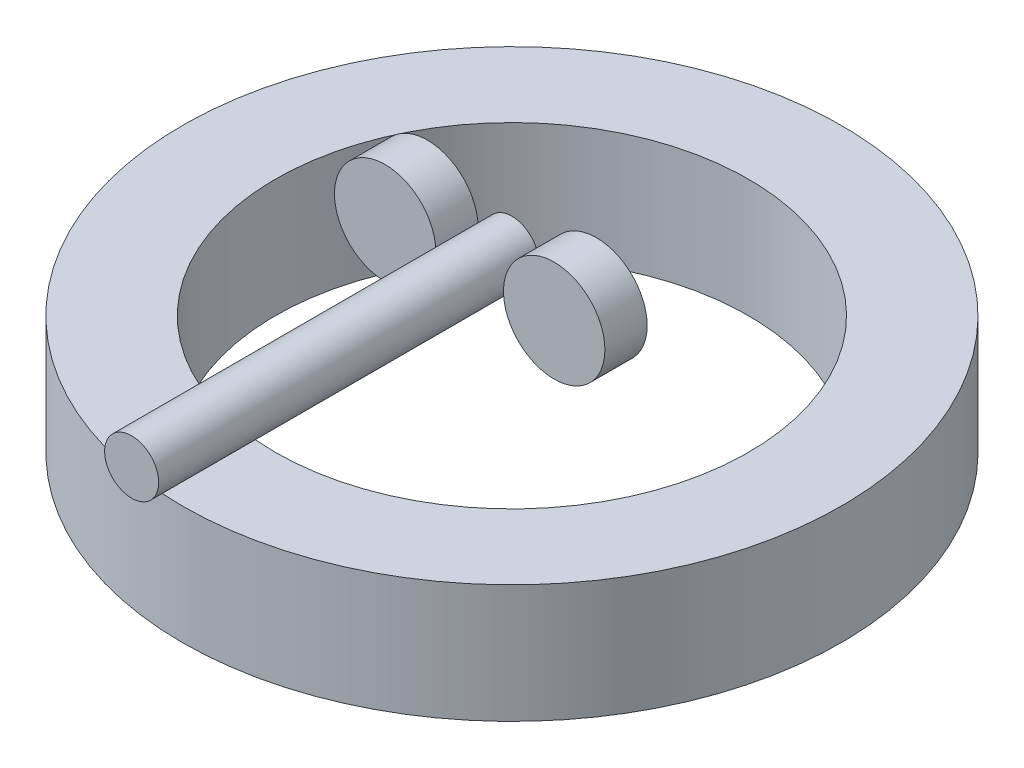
ISO-10303-21;
HEADER;
FILE_DESCRIPTION(('STEP AP214'),'2;1');
FILE_NAME('part.step','',(''),(''),'','','');
FILE_SCHEMA(('AUTOMOTIVE_DESIGN { 1 0 10303 214 1 1 1 1 }'));
ENDSEC;
DATA;
#1=APPLICATION_CONTEXT('core data for automotive mechanical design processes');
#2=APPLICATION_PROTOCOL_DEFINITION('international standard','automotive_design',2000,#1);
#3=PRODUCT_CONTEXT('',#1,'mechanical');
#4=PRODUCT('Part','Part','',(#3));
#5=PRODUCT_RELATED_PRODUCT_CATEGORY('part','',(#4));
#6=PRODUCT_DEFINITION_FORMATION('','',#4);
#7=PRODUCT_DEFINITION_CONTEXT('part definition',#1,'design');
#8=PRODUCT_DEFINITION('design','',#6,#7);
#9=PRODUCT_DEFINITION_SHAPE('','',#8);
#10=(LENGTH_UNIT() NAMED_UNIT(*) SI_UNIT(.MILLI.,.METRE.));
#11=(NAMED_UNIT(*) PLANE_ANGLE_UNIT() SI_UNIT($,.RADIAN.));
#12=(NAMED_UNIT(*) SI_UNIT($,.STERADIAN.) SOLID_ANGLE_UNIT());
#13=UNCERTAINTY_MEASURE_WITH_UNIT(LENGTH_MEASURE(1.E-05),#10,'distance_accuracy_value','');
#14=(GEOMETRIC_REPRESENTATION_CONTEXT(3) GLOBAL_UNCERTAINTY_ASSIGNED_CONTEXT((#13)) GLOBAL_UNIT_ASSIGNED_CONTEXT((#10,
#11,#12)) REPRESENTATION_CONTEXT('',''));
#15=CARTESIAN_POINT('',(0.,0.,0.));
#16=DIRECTION('',(0.,0.,1.));
#17=DIRECTION('',(1.,0.,0.));
#18=AXIS2_PLACEMENT_3D('',#15,#16,#17);
#19=CARTESIAN_POINT('',(2500.,1750.,1250.));
#20=DIRECTION('',(0.,0.,-1.));
#21=DIRECTION('',(-1.,0.,0.));
#22=AXIS2_PLACEMENT_3D('',#19,#20,#21);
#23=CYLINDRICAL_SURFACE('',#22,1500.);
#24=CARTESIAN_POINT('',(2500.,1750.,1250.));
#25=DIRECTION('',(0.,0.,1.));
#26=DIRECTION('',(1.,0.,0.));
#27=AXIS2_PLACEMENT_3D('',#24,#25,#26);
#28=CIRCLE('',#27,1500.);
#29=CARTESIAN_POINT('',(4000.,1750.,1250.));
#30=VERTEX_POINT('',#29);
#31=EDGE_CURVE('E49',#30,#30,#28,.T.);
#32=ORIENTED_EDGE('',*,*,#31,.F.);
#33=EDGE_LOOP('',(#32));
#34=FACE_BOUND('',#33,.T.);
#35=CARTESIAN_POINT('',(2500.,1750.,0.));
#36=DIRECTION('',(0.,0.,1.));
#37=DIRECTION('',(1.,0.,0.));
#38=AXIS2_PLACEMENT_3D('',#35,#36,#37);
#39=CIRCLE('',#38,1500.);
#40=CARTESIAN_POINT('',(4000.,1750.,0.));
#41=VERTEX_POINT('',#40);
#42=EDGE_CURVE('E11',#41,#41,#39,.T.);
#43=ORIENTED_EDGE('',*,*,#42,.T.);
#44=EDGE_LOOP('',(#43));
#45=FACE_BOUND('',#44,.T.);
#46=ADVANCED_FACE('F46',(#34,#45),#23,.T.);
#47=CARTESIAN_POINT('',(2500.,1750.,1250.));
#48=DIRECTION('',(0.,0.,1.));
#49=DIRECTION('',(1.,0.,0.));
#50=AXIS2_PLACEMENT_3D('',#47,#48,#49);
#51=PLANE('',#50);
#52=ORIENTED_EDGE('',*,*,#31,.T.);
#53=EDGE_LOOP('',(#52));
#54=FACE_BOUND('',#53,.T.);
#55=ADVANCED_FACE('F48',(#54),#51,.T.);
#56=CARTESIAN_POINT('',(2500.,1750.,0.));
#57=DIRECTION('',(0.,0.,1.));
#58=DIRECTION('',(1.,0.,0.));
#59=AXIS2_PLACEMENT_3D('',#56,#57,#58);
#60=PLANE('',#59);
#61=ORIENTED_EDGE('',*,*,#42,.F.);
#62=EDGE_LOOP('',(#61));
#63=FACE_BOUND('',#62,.T.);
#64=ADVANCED_FACE('F64',(#63),#60,.F.);
#65=CLOSED_SHELL('',(#46,#55,#64));
#66=MANIFOLD_SOLID_BREP('B2',#65);
#67=CARTESIAN_POINT('',(-2500.,1750.,1250.));
#68=DIRECTION('',(0.,0.,-1.));
#69=DIRECTION('',(-1.,0.,0.));
#70=AXIS2_PLACEMENT_3D('',#67,#68,#69);
#71=CYLINDRICAL_SURFACE('',#70,1500.);
#72=CARTESIAN_POINT('',(-2500.,1750.,1250.));
#73=DIRECTION('',(0.,0.,1.));
#74=DIRECTION('',(1.,0.,0.));
#75=AXIS2_PLACEMENT_3D('',#72,#73,#74);
#76=CIRCLE('',#75,1500.);
#77=CARTESIAN_POINT('',(-1000.,1750.,1250.));
#78=VERTEX_POINT('',#77);
#79=EDGE_CURVE('E44',#78,#78,#76,.T.);
#80=ORIENTED_EDGE('',*,*,#79,.F.);
#81=EDGE_LOOP('',(#80));
#82=FACE_BOUND('',#81,.T.);
#83=CARTESIAN_POINT('',(-2500.,1750.,0.));
#84=DIRECTION('',(0.,0.,1.));
#85=DIRECTION('',(1.,0.,0.));
#86=AXIS2_PLACEMENT_3D('',#83,#84,#85);
#87=CIRCLE('',#86,1500.);
#88=CARTESIAN_POINT('',(-1000.,1750.,0.));
#89=VERTEX_POINT('',#88);
#90=EDGE_CURVE('E98',#89,#89,#87,.T.);
#91=ORIENTED_EDGE('',*,*,#90,.T.);
#92=EDGE_LOOP('',(#91));
#93=FACE_BOUND('',#92,.T.);
#94=ADVANCED_FACE('F92',(#82,#93),#71,.T.);
#95=CARTESIAN_POINT('',(-2500.,1750.,1250.));
#96=DIRECTION('',(0.,0.,1.));
#97=DIRECTION('',(1.,0.,0.));
#98=AXIS2_PLACEMENT_3D('',#95,#96,#97);
#99=PLANE('',#98);
#100=ORIENTED_EDGE('',*,*,#79,.T.);
#101=EDGE_LOOP('',(#100));
#102=FACE_BOUND('',#101,.T.);
#103=ADVANCED_FACE('F109',(#102),#99,.T.);
#104=CARTESIAN_POINT('',(-2500.,1750.,0.));
#105=DIRECTION('',(0.,0.,1.));
#106=DIRECTION('',(1.,0.,0.));
#107=AXIS2_PLACEMENT_3D('',#104,#105,#106);
#108=PLANE('',#107);
#109=ORIENTED_EDGE('',*,*,#90,.F.);
#110=EDGE_LOOP('',(#109));
#111=FACE_BOUND('',#110,.T.);
#112=ADVANCED_FACE('F107',(#111),#108,.F.);
#113=CLOSED_SHELL('',(#94,#103,#112));
#114=MANIFOLD_SOLID_BREP('B6',#113);
#115=CARTESIAN_POINT('',(0.,1750.,11250.));
#116=DIRECTION('',(0.,0.,-1.));
#117=DIRECTION('',(-1.,0.,0.));
#118=AXIS2_PLACEMENT_3D('',#115,#116,#117);
#119=CYLINDRICAL_SURFACE('',#118,800.);
#120=CARTESIAN_POINT('',(0.,1750.,11250.));
#121=DIRECTION('',(0.,0.,1.));
#122=DIRECTION('',(1.,0.,0.));
#123=AXIS2_PLACEMENT_3D('',#120,#121,#122);
#124=CIRCLE('',#123,800.);
#125=CARTESIAN_POINT('',(800.,1750.,11250.));
#126=VERTEX_POINT('',#125);
#127=EDGE_CURVE('E94',#126,#126,#124,.T.);
#128=ORIENTED_EDGE('',*,*,#127,.F.);
#129=EDGE_LOOP('',(#128));
#130=FACE_BOUND('',#129,.T.);
#131=CARTESIAN_POINT('',(0.,1750.,0.));
#132=DIRECTION('',(0.,0.,1.));
#133=DIRECTION('',(1.,0.,0.));
#134=AXIS2_PLACEMENT_3D('',#131,#132,#133);
#135=CIRCLE('',#134,800.);
#136=CARTESIAN_POINT('',(800.,1750.,0.));
#137=VERTEX_POINT('',#136);
#138=EDGE_CURVE('E148',#137,#137,#135,.T.);
#139=ORIENTED_EDGE('',*,*,#138,.T.);
#140=EDGE_LOOP('',(#139));
#141=FACE_BOUND('',#140,.T.);
#142=ADVANCED_FACE('F141',(#130,#141),#119,.T.);
#143=CARTESIAN_POINT('',(0.,1750.,11250.));
#144=DIRECTION('',(0.,0.,1.));
#145=DIRECTION('',(1.,0.,0.));
#146=AXIS2_PLACEMENT_3D('',#143,#144,#145);
#147=PLANE('',#146);
#148=ORIENTED_EDGE('',*,*,#127,.T.);
#149=EDGE_LOOP('',(#148));
#150=FACE_BOUND('',#149,.T.);
#151=ADVANCED_FACE('F158',(#150),#147,.T.);
#152=CARTESIAN_POINT('',(0.,1750.,0.));
#153=DIRECTION('',(0.,0.,1.));
#154=DIRECTION('',(1.,0.,0.));
#155=AXIS2_PLACEMENT_3D('',#152,#153,#154);
#156=PLANE('',#155);
#157=ORIENTED_EDGE('',*,*,#138,.F.);
#158=EDGE_LOOP('',(#157));
#159=FACE_BOUND('',#158,.T.);
#160=ADVANCED_FACE('F156',(#159),#156,.F.);
#161=CLOSED_SHELL('',(#142,#151,#160));
#162=MANIFOLD_SOLID_BREP('B37',#161);
#163=CARTESIAN_POINT('',(0.,-3500.,0.));
#164=DIRECTION('',(0.,1.,0.));
#165=DIRECTION('',(0.,0.,1.));
#166=AXIS2_PLACEMENT_3D('',#163,#164,#165);
#167=CYLINDRICAL_SURFACE('',#166,9750.);
#168=CARTESIAN_POINT('',(0.,-3500.,0.));
#169=DIRECTION('',(0.,1.,0.));
#170=DIRECTION('',(0.,0.,1.));
#171=AXIS2_PLACEMENT_3D('',#168,#169,#170);
#172=CIRCLE('',#171,9750.);
#173=CARTESIAN_POINT('',(0.,-3500.,9750.));
#174=VERTEX_POINT('',#173);
#175=EDGE_CURVE('E142',#174,#174,#172,.T.);
#176=ORIENTED_EDGE('',*,*,#175,.T.);
#177=EDGE_LOOP('',(#176));
#178=FACE_BOUND('',#177,.T.);
#179=CARTESIAN_POINT('',(0.,0.,0.));
#180=DIRECTION('',(0.,1.,0.));
#181=DIRECTION('',(0.,0.,1.));
#182=AXIS2_PLACEMENT_3D('',#179,#180,#181);
#183=CIRCLE('',#182,9750.);
#184=CARTESIAN_POINT('',(0.,0.,9750.));
#185=VERTEX_POINT('',#184);
#186=EDGE_CURVE('E190',#185,#185,#183,.T.);
#187=ORIENTED_EDGE('',*,*,#186,.F.);
#188=EDGE_LOOP('',(#187));
#189=FACE_BOUND('',#188,.T.);
#190=ADVANCED_FACE('F184',(#178,#189),#167,.T.);
#191=CARTESIAN_POINT('',(0.,-3500.,0.));
#192=DIRECTION('',(0.,1.,0.));
#193=DIRECTION('',(0.,0.,1.));
#194=AXIS2_PLACEMENT_3D('',#191,#192,#193);
#195=PLANE('',#194);
#196=CARTESIAN_POINT('',(0.,-3500.,0.));
#197=DIRECTION('',(0.,1.,0.));
#198=DIRECTION('',(0.,0.,1.));
#199=AXIS2_PLACEMENT_3D('',#196,#197,#198);
#200=CIRCLE('',#199,7000.);
#201=CARTESIAN_POINT('',(0.,-3500.,7000.));
#202=VERTEX_POINT('',#201);
#203=EDGE_CURVE('E193',#202,#202,#200,.T.);
#204=ORIENTED_EDGE('',*,*,#203,.T.);
#205=EDGE_LOOP('',(#204));
#206=FACE_BOUND('',#205,.T.);
#207=ORIENTED_EDGE('',*,*,#175,.F.);
#208=EDGE_LOOP('',(#207));
#209=FACE_BOUND('',#208,.T.);
#210=ADVANCED_FACE('F205',(#206,#209),#195,.F.);
#211=CARTESIAN_POINT('',(0.,0.,0.));
#212=DIRECTION('',(0.,1.,0.));
#213=DIRECTION('',(0.,0.,1.));
#214=AXIS2_PLACEMENT_3D('',#211,#212,#213);
#215=PLANE('',#214);
#216=CARTESIAN_POINT('',(0.,0.,0.));
#217=DIRECTION('',(0.,1.,0.));
#218=DIRECTION('',(0.,0.,1.));
#219=AXIS2_PLACEMENT_3D('',#216,#217,#218);
#220=CIRCLE('',#219,7000.);
#221=CARTESIAN_POINT('',(0.,0.,7000.));
#222=VERTEX_POINT('',#221);
#223=EDGE_CURVE('E198',#222,#222,#220,.T.);
#224=ORIENTED_EDGE('',*,*,#223,.F.);
#225=EDGE_LOOP('',(#224));
#226=FACE_BOUND('',#225,.T.);
#227=ORIENTED_EDGE('',*,*,#186,.T.);
#228=EDGE_LOOP('',(#227));
#229=FACE_BOUND('',#228,.T.);
#230=ADVANCED_FACE('F208',(#226,#229),#215,.T.);
#231=CARTESIAN_POINT('',(0.,-3500.,0.));
#232=DIRECTION('',(0.,1.,0.));
#233=DIRECTION('',(0.,0.,1.));
#234=AXIS2_PLACEMENT_3D('',#231,#232,#233);
#235=CYLINDRICAL_SURFACE('',#234,7000.);
#236=ORIENTED_EDGE('',*,*,#203,.F.);
#237=EDGE_LOOP('',(#236));
#238=FACE_BOUND('',#237,.T.);
#239=ORIENTED_EDGE('',*,*,#223,.T.);
#240=EDGE_LOOP('',(#239));
#241=FACE_BOUND('',#240,.T.);
#242=ADVANCED_FACE('F202',(#238,#241),#235,.F.);
#243=CLOSED_SHELL('',(#190,#210,#230,#242));
#244=MANIFOLD_SOLID_BREP('B90',#243);
#245=ADVANCED_BREP_SHAPE_REPRESENTATION('',(#18,#66,#114,#162,#244),#14);
#246=SHAPE_DEFINITION_REPRESENTATION(#9,#245);
ENDSEC;
END-ISO-10303-21;
